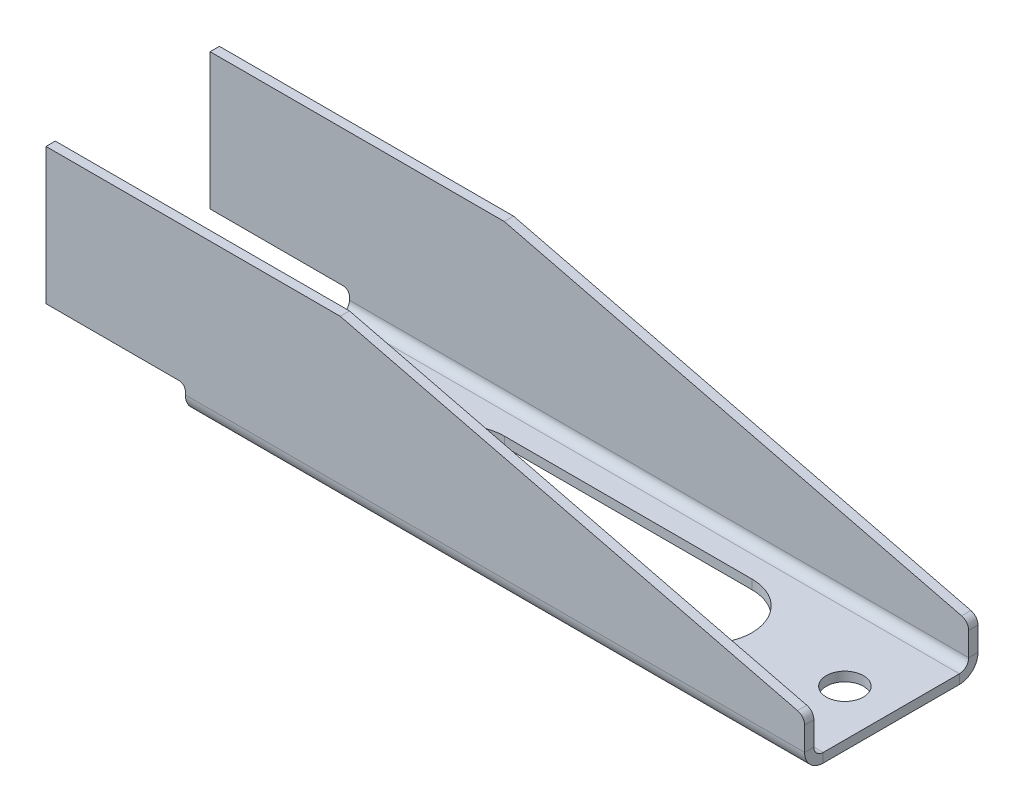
ISO-10303-21;
HEADER;
FILE_DESCRIPTION(('STEP AP214'),'2;1');
FILE_NAME('part.step','',(''),(''),'','','');
FILE_SCHEMA(('AUTOMOTIVE_DESIGN { 1 0 10303 214 1 1 1 1 }'));
ENDSEC;
DATA;
#1=APPLICATION_CONTEXT('core data for automotive mechanical design processes');
#2=APPLICATION_PROTOCOL_DEFINITION('international standard','automotive_design',2000,#1);
#3=PRODUCT_CONTEXT('',#1,'mechanical');
#4=PRODUCT('Part','Part','',(#3));
#5=PRODUCT_RELATED_PRODUCT_CATEGORY('part','',(#4));
#6=PRODUCT_DEFINITION_FORMATION('','',#4);
#7=PRODUCT_DEFINITION_CONTEXT('part definition',#1,'design');
#8=PRODUCT_DEFINITION('design','',#6,#7);
#9=PRODUCT_DEFINITION_SHAPE('','',#8);
#10=(LENGTH_UNIT() NAMED_UNIT(*) SI_UNIT(.MILLI.,.METRE.));
#11=(NAMED_UNIT(*) PLANE_ANGLE_UNIT() SI_UNIT($,.RADIAN.));
#12=(NAMED_UNIT(*) SI_UNIT($,.STERADIAN.) SOLID_ANGLE_UNIT());
#13=UNCERTAINTY_MEASURE_WITH_UNIT(LENGTH_MEASURE(1.E-05),#10,'distance_accuracy_value','');
#14=(GEOMETRIC_REPRESENTATION_CONTEXT(3) GLOBAL_UNCERTAINTY_ASSIGNED_CONTEXT((#13)) GLOBAL_UNIT_ASSIGNED_CONTEXT((#10,
#11,#12)) REPRESENTATION_CONTEXT('',''));
#15=CARTESIAN_POINT('',(0.,0.,0.));
#16=DIRECTION('',(0.,0.,1.));
#17=DIRECTION('',(1.,0.,0.));
#18=AXIS2_PLACEMENT_3D('',#15,#16,#17);
#19=CARTESIAN_POINT('',(0.,53.,-50.0000000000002));
#20=DIRECTION('',(1.,0.,0.));
#21=DIRECTION('',(0.,0.,-1.));
#22=AXIS2_PLACEMENT_3D('',#19,#20,#21);
#23=PLANE('',#22);
#24=DIRECTION('',(0.,-1.,0.));
#25=VECTOR('',#24,1.);
#26=CARTESIAN_POINT('',(0.,53.,-47.0000000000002));
#27=LINE('',#26,#25);
#28=CARTESIAN_POINT('',(0.,5.99999999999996,-47.));
#29=VERTEX_POINT('',#28);
#30=CARTESIAN_POINT('',(0.,6.99999999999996,-47.));
#31=VERTEX_POINT('',#30);
#32=EDGE_CURVE('E375',#29,#31,#27,.F.);
#33=ORIENTED_EDGE('',*,*,#32,.T.);
#34=DIRECTION('',(0.,0.,1.));
#35=VECTOR('',#34,1.);
#36=CARTESIAN_POINT('',(0.,6.99999999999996,-50.));
#37=LINE('',#36,#35);
#38=CARTESIAN_POINT('',(0.,6.99999999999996,-50.));
#39=VERTEX_POINT('',#38);
#40=EDGE_CURVE('E479',#31,#39,#37,.F.);
#41=ORIENTED_EDGE('',*,*,#40,.T.);
#42=DIRECTION('',(0.,1.,0.));
#43=VECTOR('',#42,1.);
#44=CARTESIAN_POINT('',(0.,53.,-50.0000000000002));
#45=LINE('',#44,#43);
#46=CARTESIAN_POINT('',(0.,6.00000000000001,-50.));
#47=VERTEX_POINT('',#46);
#48=EDGE_CURVE('E268',#47,#39,#45,.T.);
#49=ORIENTED_EDGE('',*,*,#48,.F.);
#50=DIRECTION('',(0.,0.,1.));
#51=VECTOR('',#50,1.);
#52=CARTESIAN_POINT('',(0.,5.99999999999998,-47.));
#53=LINE('',#52,#51);
#54=EDGE_CURVE('E383',#29,#47,#53,.F.);
#55=ORIENTED_EDGE('',*,*,#54,.F.);
#56=EDGE_LOOP('',(#33,#41,#49,#55));
#57=FACE_BOUND('',#56,.T.);
#58=ADVANCED_FACE('F74',(#57),#23,.F.);
#59=CARTESIAN_POINT('',(0.,3.,5.99999999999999));
#60=DIRECTION('',(1.,0.,0.));
#61=DIRECTION('',(0.,0.,-1.));
#62=AXIS2_PLACEMENT_3D('',#59,#60,#61);
#63=PLANE('',#62);
#64=DIRECTION('',(0.,-1.,0.));
#65=VECTOR('',#64,1.);
#66=CARTESIAN_POINT('',(0.,3.,5.99999999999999));
#67=LINE('',#66,#65);
#68=CARTESIAN_POINT('',(0.,6.99999999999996,5.99999999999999));
#69=VERTEX_POINT('',#68);
#70=CARTESIAN_POINT('',(0.,5.99999999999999,5.99999999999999));
#71=VERTEX_POINT('',#70);
#72=EDGE_CURVE('E402',#69,#71,#67,.T.);
#73=ORIENTED_EDGE('',*,*,#72,.F.);
#74=DIRECTION('',(0.,0.,1.));
#75=VECTOR('',#74,1.);
#76=CARTESIAN_POINT('',(0.,6.99999999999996,2.99999999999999));
#77=LINE('',#76,#75);
#78=CARTESIAN_POINT('',(0.,6.99999999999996,2.99999999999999));
#79=VERTEX_POINT('',#78);
#80=EDGE_CURVE('E474',#69,#79,#77,.F.);
#81=ORIENTED_EDGE('',*,*,#80,.T.);
#82=DIRECTION('',(0.,1.,0.));
#83=VECTOR('',#82,1.);
#84=CARTESIAN_POINT('',(0.,3.,2.99999999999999));
#85=LINE('',#84,#83);
#86=CARTESIAN_POINT('',(0.,5.99999999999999,2.99999999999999));
#87=VERTEX_POINT('',#86);
#88=EDGE_CURVE('E409',#79,#87,#85,.F.);
#89=ORIENTED_EDGE('',*,*,#88,.T.);
#90=DIRECTION('',(0.,0.,-1.));
#91=VECTOR('',#90,1.);
#92=CARTESIAN_POINT('',(0.,5.99999999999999,5.99999999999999));
#93=LINE('',#92,#91);
#94=EDGE_CURVE('E393',#87,#71,#93,.F.);
#95=ORIENTED_EDGE('',*,*,#94,.T.);
#96=EDGE_LOOP('',(#73,#81,#89,#95));
#97=FACE_BOUND('',#96,.T.);
#98=ADVANCED_FACE('F521',(#97),#63,.F.);
#99=CARTESIAN_POINT('',(0.,3.,0.));
#100=DIRECTION('',(1.,0.,0.));
#101=DIRECTION('',(0.,0.,-1.));
#102=AXIS2_PLACEMENT_3D('',#99,#100,#101);
#103=PLANE('',#102);
#104=DIRECTION('',(0.,0.,1.));
#105=VECTOR('',#104,1.);
#106=CARTESIAN_POINT('',(0.,0.,0.));
#107=LINE('',#106,#105);
#108=CARTESIAN_POINT('',(0.,0.,-44.));
#109=VERTEX_POINT('',#108);
#110=CARTESIAN_POINT('',(0.,0.,-37.));
#111=VERTEX_POINT('',#110);
#112=EDGE_CURVE('E449',#109,#111,#107,.T.);
#113=ORIENTED_EDGE('',*,*,#112,.T.);
#114=DIRECTION('',(0.,1.,0.));
#115=VECTOR('',#114,1.);
#116=CARTESIAN_POINT('',(0.,-0.00100000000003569,-37.));
#117=LINE('',#116,#115);
#118=CARTESIAN_POINT('',(0.,3.,-37.));
#119=VERTEX_POINT('',#118);
#120=EDGE_CURVE('E350',#111,#119,#117,.T.);
#121=ORIENTED_EDGE('',*,*,#120,.T.);
#122=DIRECTION('',(0.,0.,1.));
#123=VECTOR('',#122,1.);
#124=CARTESIAN_POINT('',(0.,3.,0.));
#125=LINE('',#124,#123);
#126=CARTESIAN_POINT('',(0.,3.,-44.));
#127=VERTEX_POINT('',#126);
#128=EDGE_CURVE('E438',#127,#119,#125,.T.);
#129=ORIENTED_EDGE('',*,*,#128,.F.);
#130=DIRECTION('',(0.,-1.,0.));
#131=VECTOR('',#130,1.);
#132=CARTESIAN_POINT('',(0.,3.,-44.));
#133=LINE('',#132,#131);
#134=EDGE_CURVE('E448',#127,#109,#133,.T.);
#135=ORIENTED_EDGE('',*,*,#134,.T.);
#136=EDGE_LOOP('',(#113,#121,#129,#135));
#137=FACE_BOUND('',#136,.T.);
#138=ADVANCED_FACE('F560',(#137),#103,.F.);
#139=CARTESIAN_POINT('',(200.,53.,5.99999999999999));
#140=DIRECTION('',(-1.,0.,0.));
#141=DIRECTION('',(0.,0.,1.));
#142=AXIS2_PLACEMENT_3D('',#139,#140,#141);
#143=PLANE('',#142);
#144=DIRECTION('',(0.,-1.,0.));
#145=VECTOR('',#144,1.);
#146=CARTESIAN_POINT('',(200.,53.,2.99999999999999));
#147=LINE('',#146,#145);
#148=CARTESIAN_POINT('',(200.,5.99999999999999,2.99999999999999));
#149=VERTEX_POINT('',#148);
#150=CARTESIAN_POINT('',(200.,13.6500809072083,2.99999999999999));
#151=VERTEX_POINT('',#150);
#152=EDGE_CURVE('E413',#149,#151,#147,.F.);
#153=ORIENTED_EDGE('',*,*,#152,.T.);
#154=DIRECTION('',(0.,0.,-1.));
#155=VECTOR('',#154,1.);
#156=CARTESIAN_POINT('',(200.,13.6500809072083,5.99999999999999));
#157=LINE('',#156,#155);
#158=CARTESIAN_POINT('',(200.,13.6500809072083,5.99999999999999));
#159=VERTEX_POINT('',#158);
#160=EDGE_CURVE('E498',#151,#159,#157,.F.);
#161=ORIENTED_EDGE('',*,*,#160,.T.);
#162=DIRECTION('',(0.,1.,0.));
#163=VECTOR('',#162,1.);
#164=CARTESIAN_POINT('',(200.,3.,5.99999999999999));
#165=LINE('',#164,#163);
#166=CARTESIAN_POINT('',(200.,5.99999999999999,5.99999999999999));
#167=VERTEX_POINT('',#166);
#168=EDGE_CURVE('E407',#167,#159,#165,.T.);
#169=ORIENTED_EDGE('',*,*,#168,.F.);
#170=DIRECTION('',(0.,0.,-1.));
#171=VECTOR('',#170,1.);
#172=CARTESIAN_POINT('',(200.,5.99999999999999,3.));
#173=LINE('',#172,#171);
#174=EDGE_CURVE('E419',#149,#167,#173,.F.);
#175=ORIENTED_EDGE('',*,*,#174,.F.);
#176=EDGE_LOOP('',(#153,#161,#169,#175));
#177=FACE_BOUND('',#176,.T.);
#178=ADVANCED_FACE('F504',(#177),#143,.F.);
#179=CARTESIAN_POINT('',(200.,3.,5.99999999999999));
#180=DIRECTION('',(0.,0.,-1.));
#181=DIRECTION('',(-1.,0.,0.));
#182=AXIS2_PLACEMENT_3D('',#179,#180,#181);
#183=PLANE('',#182);
#184=ORIENTED_EDGE('',*,*,#168,.T.);
#185=CARTESIAN_POINT('',(197.,13.6500809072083,5.99999999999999));
#186=DIRECTION('',(0.,0.,-1.));
#187=DIRECTION('',(-1.,0.,0.));
#188=AXIS2_PLACEMENT_3D('',#185,#186,#187);
#189=CIRCLE('',#188,3.);
#190=CARTESIAN_POINT('',(197.718465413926,16.5627785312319,5.99999999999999));
#191=VERTEX_POINT('',#190);
#192=EDGE_CURVE('E96',#159,#191,#189,.F.);
#193=ORIENTED_EDGE('',*,*,#192,.T.);
#194=DIRECTION('',(-0.970899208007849,0.239488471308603,0.));
#195=VECTOR('',#194,1.);
#196=CARTESIAN_POINT('',(203.022749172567,15.2543885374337,5.99999999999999));
#197=LINE('',#196,#195);
#198=CARTESIAN_POINT('',(50.0000000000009,53.,5.99999999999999));
#199=VERTEX_POINT('',#198);
#200=EDGE_CURVE('E356',#191,#199,#197,.T.);
#201=ORIENTED_EDGE('',*,*,#200,.T.);
#202=DIRECTION('',(-1.,0.,0.));
#203=VECTOR('',#202,1.);
#204=CARTESIAN_POINT('',(200.,53.,5.99999999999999));
#205=LINE('',#204,#203);
#206=CARTESIAN_POINT('',(-45.,53.,5.99999999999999));
#207=VERTEX_POINT('',#206);
#208=EDGE_CURVE('E405',#199,#207,#205,.T.);
#209=ORIENTED_EDGE('',*,*,#208,.T.);
#210=DIRECTION('',(0.,1.,0.));
#211=VECTOR('',#210,1.);
#212=CARTESIAN_POINT('',(-45.,8.99999999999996,5.99999999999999));
#213=LINE('',#212,#211);
#214=CARTESIAN_POINT('',(-45.,8.99999999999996,5.99999999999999));
#215=VERTEX_POINT('',#214);
#216=EDGE_CURVE('E291',#215,#207,#213,.T.);
#217=ORIENTED_EDGE('',*,*,#216,.F.);
#218=DIRECTION('',(1.,0.,0.));
#219=VECTOR('',#218,1.);
#220=CARTESIAN_POINT('',(-45.,8.99999999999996,5.99999999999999));
#221=LINE('',#220,#219);
#222=CARTESIAN_POINT('',(-2.00000000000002,8.99999999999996,5.99999999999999));
#223=VERTEX_POINT('',#222);
#224=EDGE_CURVE('E301',#215,#223,#221,.T.);
#225=ORIENTED_EDGE('',*,*,#224,.T.);
#226=CARTESIAN_POINT('',(-2.,6.99999999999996,5.99999999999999));
#227=DIRECTION('',(0.,0.,-1.));
#228=DIRECTION('',(-1.,0.,0.));
#229=AXIS2_PLACEMENT_3D('',#226,#227,#228);
#230=CIRCLE('',#229,2.);
#231=EDGE_CURVE('E481',#223,#69,#230,.T.);
#232=ORIENTED_EDGE('',*,*,#231,.T.);
#233=ORIENTED_EDGE('',*,*,#72,.T.);
#234=DIRECTION('',(1.,0.,0.));
#235=VECTOR('',#234,1.);
#236=CARTESIAN_POINT('',(0.,5.99999999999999,5.99999999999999));
#237=LINE('',#236,#235);
#238=EDGE_CURVE('E416',#167,#71,#237,.F.);
#239=ORIENTED_EDGE('',*,*,#238,.F.);
#240=EDGE_LOOP('',(#184,#193,#201,#209,#217,#225,#232,#233,#239));
#241=FACE_BOUND('',#240,.T.);
#242=ADVANCED_FACE('F510',(#241),#183,.F.);
#243=CARTESIAN_POINT('',(200.,3.,2.99999999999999));
#244=DIRECTION('',(0.,0.,-1.));
#245=DIRECTION('',(-1.,0.,0.));
#246=AXIS2_PLACEMENT_3D('',#243,#244,#245);
#247=PLANE('',#246);
#248=DIRECTION('',(-0.970899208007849,0.239488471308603,0.));
#249=VECTOR('',#248,1.);
#250=CARTESIAN_POINT('',(203.022749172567,15.2543885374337,2.99999999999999));
#251=LINE('',#250,#249);
#252=CARTESIAN_POINT('',(197.718465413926,16.5627785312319,2.99999999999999));
#253=VERTEX_POINT('',#252);
#254=CARTESIAN_POINT('',(50.0000000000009,53.,2.99999999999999));
#255=VERTEX_POINT('',#254);
#256=EDGE_CURVE('E353',#253,#255,#251,.T.);
#257=ORIENTED_EDGE('',*,*,#256,.F.);
#258=CARTESIAN_POINT('',(197.,13.6500809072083,2.99999999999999));
#259=DIRECTION('',(0.,0.,-1.));
#260=DIRECTION('',(-1.,0.,0.));
#261=AXIS2_PLACEMENT_3D('',#258,#259,#260);
#262=CIRCLE('',#261,3.);
#263=EDGE_CURVE('E13',#253,#151,#262,.T.);
#264=ORIENTED_EDGE('',*,*,#263,.T.);
#265=ORIENTED_EDGE('',*,*,#152,.F.);
#266=DIRECTION('',(1.,0.,0.));
#267=VECTOR('',#266,1.);
#268=CARTESIAN_POINT('',(0.,5.99999999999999,2.99999999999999));
#269=LINE('',#268,#267);
#270=EDGE_CURVE('E422',#87,#149,#269,.T.);
#271=ORIENTED_EDGE('',*,*,#270,.F.);
#272=ORIENTED_EDGE('',*,*,#88,.F.);
#273=CARTESIAN_POINT('',(-2.,6.99999999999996,2.99999999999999));
#274=DIRECTION('',(0.,0.,-1.));
#275=DIRECTION('',(-1.,0.,0.));
#276=AXIS2_PLACEMENT_3D('',#273,#274,#275);
#277=CIRCLE('',#276,2.);
#278=CARTESIAN_POINT('',(-2.00000000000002,8.99999999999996,2.99999999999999));
#279=VERTEX_POINT('',#278);
#280=EDGE_CURVE('E483',#79,#279,#277,.F.);
#281=ORIENTED_EDGE('',*,*,#280,.T.);
#282=DIRECTION('',(1.,0.,0.));
#283=VECTOR('',#282,1.);
#284=CARTESIAN_POINT('',(-45.,8.99999999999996,2.99999999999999));
#285=LINE('',#284,#283);
#286=CARTESIAN_POINT('',(-45.,8.99999999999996,2.99999999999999));
#287=VERTEX_POINT('',#286);
#288=EDGE_CURVE('E304',#287,#279,#285,.T.);
#289=ORIENTED_EDGE('',*,*,#288,.F.);
#290=DIRECTION('',(0.,-1.,0.));
#291=VECTOR('',#290,1.);
#292=CARTESIAN_POINT('',(-45.,53.,2.99999999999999));
#293=LINE('',#292,#291);
#294=CARTESIAN_POINT('',(-45.,53.,2.99999999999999));
#295=VERTEX_POINT('',#294);
#296=EDGE_CURVE('E297',#295,#287,#293,.T.);
#297=ORIENTED_EDGE('',*,*,#296,.F.);
#298=DIRECTION('',(1.,0.,0.));
#299=VECTOR('',#298,1.);
#300=CARTESIAN_POINT('',(0.,53.,2.99999999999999));
#301=LINE('',#300,#299);
#302=EDGE_CURVE('E411',#255,#295,#301,.F.);
#303=ORIENTED_EDGE('',*,*,#302,.F.);
#304=EDGE_LOOP('',(#257,#264,#265,#271,#272,#281,#289,#297,#303));
#305=FACE_BOUND('',#304,.T.);
#306=ADVANCED_FACE('F527',(#305),#247,.T.);
#307=CARTESIAN_POINT('',(0.,53.,5.99999999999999));
#308=DIRECTION('',(0.,-1.,0.));
#309=DIRECTION('',(0.,0.,-1.));
#310=AXIS2_PLACEMENT_3D('',#307,#308,#309);
#311=PLANE('',#310);
#312=DIRECTION('',(0.,0.,-1.));
#313=VECTOR('',#312,1.);
#314=CARTESIAN_POINT('',(50.0000000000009,53.,2.99999999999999));
#315=LINE('',#314,#313);
#316=EDGE_CURVE('E358',#255,#199,#315,.F.);
#317=ORIENTED_EDGE('',*,*,#316,.F.);
#318=ORIENTED_EDGE('',*,*,#302,.T.);
#319=DIRECTION('',(0.,0.,-1.));
#320=VECTOR('',#319,1.);
#321=CARTESIAN_POINT('',(-45.,53.,5.99999999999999));
#322=LINE('',#321,#320);
#323=EDGE_CURVE('E294',#207,#295,#322,.T.);
#324=ORIENTED_EDGE('',*,*,#323,.F.);
#325=ORIENTED_EDGE('',*,*,#208,.F.);
#326=EDGE_LOOP('',(#317,#318,#324,#325));
#327=FACE_BOUND('',#326,.T.);
#328=ADVANCED_FACE('F545',(#327),#311,.F.);
#329=CARTESIAN_POINT('',(200.,2.99999999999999,-50.));
#330=DIRECTION('',(-1.,0.,0.));
#331=DIRECTION('',(0.,0.,1.));
#332=AXIS2_PLACEMENT_3D('',#329,#330,#331);
#333=PLANE('',#332);
#334=DIRECTION('',(0.,-1.,0.));
#335=VECTOR('',#334,1.);
#336=CARTESIAN_POINT('',(200.,53.,-50.0000000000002));
#337=LINE('',#336,#335);
#338=CARTESIAN_POINT('',(200.,13.6500809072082,-50.));
#339=VERTEX_POINT('',#338);
#340=CARTESIAN_POINT('',(200.,5.99999999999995,-50.));
#341=VERTEX_POINT('',#340);
#342=EDGE_CURVE('E371',#339,#341,#337,.T.);
#343=ORIENTED_EDGE('',*,*,#342,.F.);
#344=DIRECTION('',(0.,0.,1.));
#345=VECTOR('',#344,1.);
#346=CARTESIAN_POINT('',(200.,13.6500809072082,-47.0000000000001));
#347=LINE('',#346,#345);
#348=CARTESIAN_POINT('',(200.,13.6500809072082,-47.));
#349=VERTEX_POINT('',#348);
#350=EDGE_CURVE('E494',#339,#349,#347,.T.);
#351=ORIENTED_EDGE('',*,*,#350,.T.);
#352=DIRECTION('',(0.,1.,0.));
#353=VECTOR('',#352,1.);
#354=CARTESIAN_POINT('',(200.,3.,-47.));
#355=LINE('',#354,#353);
#356=CARTESIAN_POINT('',(200.,5.99999999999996,-47.));
#357=VERTEX_POINT('',#356);
#358=EDGE_CURVE('E378',#349,#357,#355,.F.);
#359=ORIENTED_EDGE('',*,*,#358,.T.);
#360=DIRECTION('',(0.,0.,1.));
#361=VECTOR('',#360,1.);
#362=CARTESIAN_POINT('',(200.,6.00000000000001,-50.));
#363=LINE('',#362,#361);
#364=EDGE_CURVE('E367',#357,#341,#363,.F.);
#365=ORIENTED_EDGE('',*,*,#364,.T.);
#366=EDGE_LOOP('',(#343,#351,#359,#365));
#367=FACE_BOUND('',#366,.T.);
#368=ADVANCED_FACE('F565',(#367),#333,.F.);
#369=CARTESIAN_POINT('',(200.,53.,-50.0000000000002));
#370=DIRECTION('',(0.,0.,1.));
#371=DIRECTION('',(0.,-1.,0.));
#372=AXIS2_PLACEMENT_3D('',#369,#370,#371);
#373=PLANE('',#372);
#374=DIRECTION('',(0.970899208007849,-0.239488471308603,0.));
#375=VECTOR('',#374,1.);
#376=CARTESIAN_POINT('',(191.39679081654,18.1221249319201,-50.));
#377=LINE('',#376,#375);
#378=CARTESIAN_POINT('',(50.0000000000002,53.,-50.0000000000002));
#379=VERTEX_POINT('',#378);
#380=CARTESIAN_POINT('',(197.718465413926,16.5627785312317,-50.));
#381=VERTEX_POINT('',#380);
#382=EDGE_CURVE('E363',#379,#381,#377,.T.);
#383=ORIENTED_EDGE('',*,*,#382,.T.);
#384=CARTESIAN_POINT('',(197.,13.6500809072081,-50.));
#385=DIRECTION('',(0.,0.,1.));
#386=DIRECTION('',(0.,-1.,0.));
#387=AXIS2_PLACEMENT_3D('',#384,#385,#386);
#388=CIRCLE('',#387,3.);
#389=EDGE_CURVE('E492',#381,#339,#388,.F.);
#390=ORIENTED_EDGE('',*,*,#389,.T.);
#391=ORIENTED_EDGE('',*,*,#342,.T.);
#392=DIRECTION('',(-1.,0.,0.));
#393=VECTOR('',#392,1.);
#394=CARTESIAN_POINT('',(200.,6.00000000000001,-50.));
#395=LINE('',#394,#393);
#396=EDGE_CURVE('E380',#47,#341,#395,.F.);
#397=ORIENTED_EDGE('',*,*,#396,.F.);
#398=ORIENTED_EDGE('',*,*,#48,.T.);
#399=CARTESIAN_POINT('',(-2.,6.99999999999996,-50.));
#400=DIRECTION('',(0.,0.,1.));
#401=DIRECTION('',(0.,-1.,0.));
#402=AXIS2_PLACEMENT_3D('',#399,#400,#401);
#403=CIRCLE('',#402,2.);
#404=CARTESIAN_POINT('',(-2.00000000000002,8.99999999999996,-50.0000000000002));
#405=VERTEX_POINT('',#404);
#406=EDGE_CURVE('E487',#39,#405,#403,.T.);
#407=ORIENTED_EDGE('',*,*,#406,.T.);
#408=DIRECTION('',(1.,0.,0.));
#409=VECTOR('',#408,1.);
#410=CARTESIAN_POINT('',(-45.,8.99999999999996,-50.0000000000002));
#411=LINE('',#410,#409);
#412=CARTESIAN_POINT('',(-45.,8.99999999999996,-50.0000000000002));
#413=VERTEX_POINT('',#412);
#414=EDGE_CURVE('E274',#413,#405,#411,.T.);
#415=ORIENTED_EDGE('',*,*,#414,.F.);
#416=DIRECTION('',(0.,-1.,0.));
#417=VECTOR('',#416,1.);
#418=CARTESIAN_POINT('',(-45.,8.99999999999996,-50.0000000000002));
#419=LINE('',#418,#417);
#420=CARTESIAN_POINT('',(-45.,53.,-50.0000000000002));
#421=VERTEX_POINT('',#420);
#422=EDGE_CURVE('E271',#421,#413,#419,.T.);
#423=ORIENTED_EDGE('',*,*,#422,.F.);
#424=DIRECTION('',(1.,0.,0.));
#425=VECTOR('',#424,1.);
#426=CARTESIAN_POINT('',(200.,53.,-50.0000000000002));
#427=LINE('',#426,#425);
#428=EDGE_CURVE('E258',#421,#379,#427,.T.);
#429=ORIENTED_EDGE('',*,*,#428,.T.);
#430=EDGE_LOOP('',(#383,#390,#391,#397,#398,#407,#415,#423,#429));
#431=FACE_BOUND('',#430,.T.);
#432=ADVANCED_FACE('F272',(#431),#373,.F.);
#433=CARTESIAN_POINT('',(200.,53.,-47.0000000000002));
#434=DIRECTION('',(0.,0.,1.));
#435=DIRECTION('',(0.,-1.,0.));
#436=AXIS2_PLACEMENT_3D('',#433,#434,#435);
#437=PLANE('',#436);
#438=ORIENTED_EDGE('',*,*,#358,.F.);
#439=CARTESIAN_POINT('',(197.,13.6500809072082,-47.));
#440=DIRECTION('',(0.,0.,1.));
#441=DIRECTION('',(0.,-1.,0.));
#442=AXIS2_PLACEMENT_3D('',#439,#440,#441);
#443=CIRCLE('',#442,3.);
#444=CARTESIAN_POINT('',(197.718465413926,16.5627785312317,-47.));
#445=VERTEX_POINT('',#444);
#446=EDGE_CURVE('E496',#349,#445,#443,.T.);
#447=ORIENTED_EDGE('',*,*,#446,.T.);
#448=DIRECTION('',(0.970899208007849,-0.239488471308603,0.));
#449=VECTOR('',#448,1.);
#450=CARTESIAN_POINT('',(191.39679081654,18.1221249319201,-47.));
#451=LINE('',#450,#449);
#452=CARTESIAN_POINT('',(50.0000000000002,53.,-47.0000000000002));
#453=VERTEX_POINT('',#452);
#454=EDGE_CURVE('E362',#453,#445,#451,.T.);
#455=ORIENTED_EDGE('',*,*,#454,.F.);
#456=DIRECTION('',(-1.,0.,0.));
#457=VECTOR('',#456,1.);
#458=CARTESIAN_POINT('',(200.,53.,-47.0000000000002));
#459=LINE('',#458,#457);
#460=CARTESIAN_POINT('',(-45.,53.,-47.0000000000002));
#461=VERTEX_POINT('',#460);
#462=EDGE_CURVE('E373',#461,#453,#459,.F.);
#463=ORIENTED_EDGE('',*,*,#462,.F.);
#464=DIRECTION('',(0.,1.,0.));
#465=VECTOR('',#464,1.);
#466=CARTESIAN_POINT('',(-45.,53.,-47.0000000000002));
#467=LINE('',#466,#465);
#468=CARTESIAN_POINT('',(-45.,8.99999999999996,-47.0000000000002));
#469=VERTEX_POINT('',#468);
#470=EDGE_CURVE('E282',#469,#461,#467,.T.);
#471=ORIENTED_EDGE('',*,*,#470,.F.);
#472=DIRECTION('',(1.,0.,0.));
#473=VECTOR('',#472,1.);
#474=CARTESIAN_POINT('',(-45.,8.99999999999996,-47.0000000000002));
#475=LINE('',#474,#473);
#476=CARTESIAN_POINT('',(-2.00000000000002,8.99999999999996,-47.0000000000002));
#477=VERTEX_POINT('',#476);
#478=EDGE_CURVE('E287',#469,#477,#475,.T.);
#479=ORIENTED_EDGE('',*,*,#478,.T.);
#480=CARTESIAN_POINT('',(-2.,6.99999999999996,-47.));
#481=DIRECTION('',(0.,0.,1.));
#482=DIRECTION('',(0.,-1.,0.));
#483=AXIS2_PLACEMENT_3D('',#480,#481,#482);
#484=CIRCLE('',#483,2.);
#485=EDGE_CURVE('E485',#477,#31,#484,.F.);
#486=ORIENTED_EDGE('',*,*,#485,.T.);
#487=ORIENTED_EDGE('',*,*,#32,.F.);
#488=DIRECTION('',(-1.,0.,0.));
#489=VECTOR('',#488,1.);
#490=CARTESIAN_POINT('',(200.,5.99999999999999,-47.));
#491=LINE('',#490,#489);
#492=EDGE_CURVE('E386',#357,#29,#491,.T.);
#493=ORIENTED_EDGE('',*,*,#492,.F.);
#494=EDGE_LOOP('',(#438,#447,#455,#463,#471,#479,#486,#487,#493));
#495=FACE_BOUND('',#494,.T.);
#496=ADVANCED_FACE('F638',(#495),#437,.T.);
#497=CARTESIAN_POINT('',(200.,53.,-50.0000000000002));
#498=DIRECTION('',(0.,-1.,0.));
#499=DIRECTION('',(0.,0.,-1.));
#500=AXIS2_PLACEMENT_3D('',#497,#498,#499);
#501=PLANE('',#500);
#502=DIRECTION('',(0.,0.,1.));
#503=VECTOR('',#502,1.);
#504=CARTESIAN_POINT('',(50.0000000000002,53.,-47.0000000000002));
#505=LINE('',#504,#503);
#506=EDGE_CURVE('E264',#453,#379,#505,.F.);
#507=ORIENTED_EDGE('',*,*,#506,.T.);
#508=ORIENTED_EDGE('',*,*,#428,.F.);
#509=DIRECTION('',(0.,0.,-1.));
#510=VECTOR('',#509,1.);
#511=CARTESIAN_POINT('',(-45.,53.,-50.0000000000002));
#512=LINE('',#511,#510);
#513=EDGE_CURVE('E263',#461,#421,#512,.T.);
#514=ORIENTED_EDGE('',*,*,#513,.F.);
#515=ORIENTED_EDGE('',*,*,#462,.T.);
#516=EDGE_LOOP('',(#507,#508,#514,#515));
#517=FACE_BOUND('',#516,.T.);
#518=ADVANCED_FACE('F260',(#517),#501,.F.);
#519=CARTESIAN_POINT('',(0.,3.,-7.00000000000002));
#520=VERTEX_POINT('',#519);
#521=CARTESIAN_POINT('',(0.,3.,0.));
#522=VERTEX_POINT('',#521);
#523=EDGE_CURVE('E442',#520,#522,#125,.T.);
#524=ORIENTED_EDGE('',*,*,#523,.F.);
#525=DIRECTION('',(0.,1.,0.));
#526=VECTOR('',#525,1.);
#527=CARTESIAN_POINT('',(0.,-0.00100000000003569,-7.00000000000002));
#528=LINE('',#527,#526);
#529=CARTESIAN_POINT('',(0.,0.,-7.00000000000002));
#530=VERTEX_POINT('',#529);
#531=EDGE_CURVE('E351',#530,#520,#528,.T.);
#532=ORIENTED_EDGE('',*,*,#531,.F.);
#533=CARTESIAN_POINT('',(0.,0.,0.));
#534=VERTEX_POINT('',#533);
#535=EDGE_CURVE('E429',#530,#534,#107,.T.);
#536=ORIENTED_EDGE('',*,*,#535,.T.);
#537=DIRECTION('',(0.,-1.,0.));
#538=VECTOR('',#537,1.);
#539=CARTESIAN_POINT('',(0.,3.,0.));
#540=LINE('',#539,#538);
#541=EDGE_CURVE('E468',#522,#534,#540,.T.);
#542=ORIENTED_EDGE('',*,*,#541,.F.);
#543=EDGE_LOOP('',(#524,#532,#536,#542));
#544=FACE_BOUND('',#543,.T.);
#545=ADVANCED_FACE('F617',(#544),#103,.F.);
#546=CARTESIAN_POINT('',(200.,3.,0.));
#547=DIRECTION('',(-1.,0.,0.));
#548=DIRECTION('',(0.,0.,1.));
#549=AXIS2_PLACEMENT_3D('',#546,#547,#548);
#550=PLANE('',#549);
#551=DIRECTION('',(0.,0.,-1.));
#552=VECTOR('',#551,1.);
#553=CARTESIAN_POINT('',(200.,0.,0.));
#554=LINE('',#553,#552);
#555=CARTESIAN_POINT('',(200.,0.,0.));
#556=VERTEX_POINT('',#555);
#557=CARTESIAN_POINT('',(200.,0.,-44.));
#558=VERTEX_POINT('',#557);
#559=EDGE_CURVE('E455',#556,#558,#554,.T.);
#560=ORIENTED_EDGE('',*,*,#559,.T.);
#561=DIRECTION('',(0.,-1.,0.));
#562=VECTOR('',#561,1.);
#563=CARTESIAN_POINT('',(200.,3.,-44.));
#564=LINE('',#563,#562);
#565=CARTESIAN_POINT('',(200.,3.,-44.));
#566=VERTEX_POINT('',#565);
#567=EDGE_CURVE('E462',#566,#558,#564,.T.);
#568=ORIENTED_EDGE('',*,*,#567,.F.);
#569=DIRECTION('',(0.,0.,-1.));
#570=VECTOR('',#569,1.);
#571=CARTESIAN_POINT('',(200.,3.,0.));
#572=LINE('',#571,#570);
#573=CARTESIAN_POINT('',(200.,3.,0.));
#574=VERTEX_POINT('',#573);
#575=EDGE_CURVE('E444',#574,#566,#572,.T.);
#576=ORIENTED_EDGE('',*,*,#575,.F.);
#577=DIRECTION('',(0.,-1.,0.));
#578=VECTOR('',#577,1.);
#579=CARTESIAN_POINT('',(200.,3.,0.));
#580=LINE('',#579,#578);
#581=EDGE_CURVE('E465',#574,#556,#580,.T.);
#582=ORIENTED_EDGE('',*,*,#581,.T.);
#583=EDGE_LOOP('',(#560,#568,#576,#582));
#584=FACE_BOUND('',#583,.T.);
#585=ADVANCED_FACE('F610',(#584),#550,.F.);
#586=CARTESIAN_POINT('',(0.,3.,-44.));
#587=DIRECTION('',(0.,-1.,0.));
#588=DIRECTION('',(0.,0.,-1.));
#589=AXIS2_PLACEMENT_3D('',#586,#587,#588);
#590=PLANE('',#589);
#591=CARTESIAN_POINT('',(185.,3.,-22.));
#592=DIRECTION('',(0.,1.,0.));
#593=DIRECTION('',(0.,0.,1.));
#594=AXIS2_PLACEMENT_3D('',#591,#592,#593);
#595=CIRCLE('',#594,6.00000000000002);
#596=CARTESIAN_POINT('',(185.,3.,-16.));
#597=VERTEX_POINT('',#596);
#598=EDGE_CURVE('E308',#597,#597,#595,.T.);
#599=ORIENTED_EDGE('',*,*,#598,.F.);
#600=EDGE_LOOP('',(#599));
#601=FACE_BOUND('',#600,.T.);
#602=DIRECTION('',(-1.,0.,0.));
#603=VECTOR('',#602,1.);
#604=CARTESIAN_POINT('',(140.,3.,-37.));
#605=LINE('',#604,#603);
#606=CARTESIAN_POINT('',(140.,3.,-37.));
#607=VERTEX_POINT('',#606);
#608=CARTESIAN_POINT('',(60.,3.,-37.));
#609=VERTEX_POINT('',#608);
#610=EDGE_CURVE('E324',#607,#609,#605,.T.);
#611=ORIENTED_EDGE('',*,*,#610,.F.);
#612=CARTESIAN_POINT('',(140.,3.,-22.));
#613=DIRECTION('',(0.,1.,0.));
#614=DIRECTION('',(0.,0.,1.));
#615=AXIS2_PLACEMENT_3D('',#612,#613,#614);
#616=CIRCLE('',#615,15.);
#617=CARTESIAN_POINT('',(140.,3.,-6.99999999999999));
#618=VERTEX_POINT('',#617);
#619=EDGE_CURVE('E322',#618,#607,#616,.T.);
#620=ORIENTED_EDGE('',*,*,#619,.F.);
#621=DIRECTION('',(1.,0.,0.));
#622=VECTOR('',#621,1.);
#623=CARTESIAN_POINT('',(140.,3.,-6.99999999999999));
#624=LINE('',#623,#622);
#625=CARTESIAN_POINT('',(60.,3.,-6.99999999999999));
#626=VERTEX_POINT('',#625);
#627=EDGE_CURVE('E330',#626,#618,#624,.T.);
#628=ORIENTED_EDGE('',*,*,#627,.F.);
#629=CARTESIAN_POINT('',(60.,3.,-22.));
#630=DIRECTION('',(0.,1.,0.));
#631=DIRECTION('',(0.,0.,1.));
#632=AXIS2_PLACEMENT_3D('',#629,#630,#631);
#633=CIRCLE('',#632,15.);
#634=EDGE_CURVE('E327',#609,#626,#633,.T.);
#635=ORIENTED_EDGE('',*,*,#634,.F.);
#636=EDGE_LOOP('',(#611,#620,#628,#635));
#637=FACE_BOUND('',#636,.T.);
#638=ORIENTED_EDGE('',*,*,#128,.T.);
#639=CARTESIAN_POINT('',(0.,3.,-22.));
#640=DIRECTION('',(0.,1.,0.));
#641=DIRECTION('',(0.,0.,1.));
#642=AXIS2_PLACEMENT_3D('',#639,#640,#641);
#643=CIRCLE('',#642,15.);
#644=EDGE_CURVE('E348',#520,#119,#643,.T.);
#645=ORIENTED_EDGE('',*,*,#644,.F.);
#646=ORIENTED_EDGE('',*,*,#523,.T.);
#647=DIRECTION('',(1.,0.,0.));
#648=VECTOR('',#647,1.);
#649=CARTESIAN_POINT('',(0.,3.,0.));
#650=LINE('',#649,#648);
#651=EDGE_CURVE('E441',#522,#574,#650,.T.);
#652=ORIENTED_EDGE('',*,*,#651,.T.);
#653=ORIENTED_EDGE('',*,*,#575,.T.);
#654=DIRECTION('',(-1.,0.,0.));
#655=VECTOR('',#654,1.);
#656=CARTESIAN_POINT('',(0.,3.,-44.));
#657=LINE('',#656,#655);
#658=EDGE_CURVE('E446',#566,#127,#657,.T.);
#659=ORIENTED_EDGE('',*,*,#658,.T.);
#660=EDGE_LOOP('',(#638,#645,#646,#652,#653,#659));
#661=FACE_BOUND('',#660,.T.);
#662=ADVANCED_FACE('F607',(#601,#637,#661),#590,.F.);
#663=CARTESIAN_POINT('',(0.,0.,-44.));
#664=DIRECTION('',(0.,-1.,0.));
#665=DIRECTION('',(0.,0.,-1.));
#666=AXIS2_PLACEMENT_3D('',#663,#664,#665);
#667=PLANE('',#666);
#668=CARTESIAN_POINT('',(185.,0.,-22.));
#669=DIRECTION('',(0.,-1.,0.));
#670=DIRECTION('',(0.,0.,-1.));
#671=AXIS2_PLACEMENT_3D('',#668,#669,#670);
#672=CIRCLE('',#671,6.00000000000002);
#673=CARTESIAN_POINT('',(185.,0.,-28.));
#674=VERTEX_POINT('',#673);
#675=EDGE_CURVE('E307',#674,#674,#672,.F.);
#676=ORIENTED_EDGE('',*,*,#675,.T.);
#677=EDGE_LOOP('',(#676));
#678=FACE_BOUND('',#677,.T.);
#679=CARTESIAN_POINT('',(140.,0.,-22.));
#680=DIRECTION('',(0.,-1.,0.));
#681=DIRECTION('',(0.,0.,-1.));
#682=AXIS2_PLACEMENT_3D('',#679,#680,#681);
#683=CIRCLE('',#682,15.);
#684=CARTESIAN_POINT('',(140.,0.,-6.99999999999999));
#685=VERTEX_POINT('',#684);
#686=CARTESIAN_POINT('',(140.,0.,-37.));
#687=VERTEX_POINT('',#686);
#688=EDGE_CURVE('E319',#685,#687,#683,.F.);
#689=ORIENTED_EDGE('',*,*,#688,.T.);
#690=DIRECTION('',(-1.,0.,0.));
#691=VECTOR('',#690,1.);
#692=CARTESIAN_POINT('',(140.,0.,-37.));
#693=LINE('',#692,#691);
#694=CARTESIAN_POINT('',(60.,0.,-37.));
#695=VERTEX_POINT('',#694);
#696=EDGE_CURVE('E336',#687,#695,#693,.T.);
#697=ORIENTED_EDGE('',*,*,#696,.T.);
#698=CARTESIAN_POINT('',(60.,0.,-22.));
#699=DIRECTION('',(0.,-1.,0.));
#700=DIRECTION('',(0.,0.,-1.));
#701=AXIS2_PLACEMENT_3D('',#698,#699,#700);
#702=CIRCLE('',#701,15.);
#703=CARTESIAN_POINT('',(60.,0.,-6.99999999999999));
#704=VERTEX_POINT('',#703);
#705=EDGE_CURVE('E311',#695,#704,#702,.F.);
#706=ORIENTED_EDGE('',*,*,#705,.T.);
#707=DIRECTION('',(1.,0.,0.));
#708=VECTOR('',#707,1.);
#709=CARTESIAN_POINT('',(140.,0.,-6.99999999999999));
#710=LINE('',#709,#708);
#711=EDGE_CURVE('E316',#704,#685,#710,.T.);
#712=ORIENTED_EDGE('',*,*,#711,.T.);
#713=EDGE_LOOP('',(#689,#697,#706,#712));
#714=FACE_BOUND('',#713,.T.);
#715=CARTESIAN_POINT('',(0.,0.,-22.));
#716=DIRECTION('',(0.,-1.,0.));
#717=DIRECTION('',(0.,0.,-1.));
#718=AXIS2_PLACEMENT_3D('',#715,#716,#717);
#719=CIRCLE('',#718,15.);
#720=EDGE_CURVE('E345',#530,#111,#719,.F.);
#721=ORIENTED_EDGE('',*,*,#720,.T.);
#722=ORIENTED_EDGE('',*,*,#112,.F.);
#723=DIRECTION('',(-1.,0.,0.));
#724=VECTOR('',#723,1.);
#725=CARTESIAN_POINT('',(0.,0.,-44.));
#726=LINE('',#725,#724);
#727=EDGE_CURVE('E457',#558,#109,#726,.T.);
#728=ORIENTED_EDGE('',*,*,#727,.F.);
#729=ORIENTED_EDGE('',*,*,#559,.F.);
#730=DIRECTION('',(1.,0.,0.));
#731=VECTOR('',#730,1.);
#732=CARTESIAN_POINT('',(0.,0.,0.));
#733=LINE('',#732,#731);
#734=EDGE_CURVE('E452',#534,#556,#733,.T.);
#735=ORIENTED_EDGE('',*,*,#734,.F.);
#736=ORIENTED_EDGE('',*,*,#535,.F.);
#737=EDGE_LOOP('',(#721,#722,#728,#729,#735,#736));
#738=FACE_BOUND('',#737,.T.);
#739=ADVANCED_FACE('F603',(#678,#714,#738),#667,.T.);
#740=CARTESIAN_POINT('',(0.,5.99999999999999,0.));
#741=DIRECTION('',(-1.,0.,0.));
#742=DIRECTION('',(0.,0.,1.));
#743=AXIS2_PLACEMENT_3D('',#740,#741,#742);
#744=PLANE('',#743);
#745=ORIENTED_EDGE('',*,*,#94,.F.);
#746=CARTESIAN_POINT('',(0.,5.99999999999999,0.));
#747=DIRECTION('',(1.,0.,0.));
#748=DIRECTION('',(0.,0.,-1.));
#749=AXIS2_PLACEMENT_3D('',#746,#747,#748);
#750=CIRCLE('',#749,2.99999999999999);
#751=EDGE_CURVE('E433',#522,#87,#750,.F.);
#752=ORIENTED_EDGE('',*,*,#751,.F.);
#753=ORIENTED_EDGE('',*,*,#541,.T.);
#754=CARTESIAN_POINT('',(0.,5.99999999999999,0.));
#755=DIRECTION('',(1.,0.,0.));
#756=DIRECTION('',(0.,0.,-1.));
#757=AXIS2_PLACEMENT_3D('',#754,#755,#756);
#758=CIRCLE('',#757,5.99999999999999);
#759=EDGE_CURVE('E426',#534,#71,#758,.F.);
#760=ORIENTED_EDGE('',*,*,#759,.T.);
#761=EDGE_LOOP('',(#745,#752,#753,#760));
#762=FACE_BOUND('',#761,.T.);
#763=ADVANCED_FACE('F517',(#762),#744,.T.);
#764=CARTESIAN_POINT('',(200.,5.99999999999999,0.));
#765=DIRECTION('',(-1.,0.,0.));
#766=DIRECTION('',(0.,0.,1.));
#767=AXIS2_PLACEMENT_3D('',#764,#765,#766);
#768=PLANE('',#767);
#769=CARTESIAN_POINT('',(200.,5.99999999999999,0.));
#770=DIRECTION('',(1.,0.,0.));
#771=DIRECTION('',(0.,0.,-1.));
#772=AXIS2_PLACEMENT_3D('',#769,#770,#771);
#773=CIRCLE('',#772,2.99999999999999);
#774=EDGE_CURVE('E404',#149,#574,#773,.T.);
#775=ORIENTED_EDGE('',*,*,#774,.F.);
#776=ORIENTED_EDGE('',*,*,#174,.T.);
#777=CARTESIAN_POINT('',(200.,5.99999999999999,0.));
#778=DIRECTION('',(1.,0.,0.));
#779=DIRECTION('',(0.,0.,-1.));
#780=AXIS2_PLACEMENT_3D('',#777,#778,#779);
#781=CIRCLE('',#780,5.99999999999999);
#782=EDGE_CURVE('E430',#167,#556,#781,.T.);
#783=ORIENTED_EDGE('',*,*,#782,.T.);
#784=ORIENTED_EDGE('',*,*,#581,.F.);
#785=EDGE_LOOP('',(#775,#776,#783,#784));
#786=FACE_BOUND('',#785,.T.);
#787=ADVANCED_FACE('F597',(#786),#768,.F.);
#788=CARTESIAN_POINT('',(200.,5.99999999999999,0.));
#789=DIRECTION('',(1.,0.,0.));
#790=DIRECTION('',(0.,0.,1.));
#791=AXIS2_PLACEMENT_3D('',#788,#789,#790);
#792=CYLINDRICAL_SURFACE('',#791,5.99999999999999);
#793=ORIENTED_EDGE('',*,*,#734,.T.);
#794=ORIENTED_EDGE('',*,*,#782,.F.);
#795=ORIENTED_EDGE('',*,*,#238,.T.);
#796=ORIENTED_EDGE('',*,*,#759,.F.);
#797=EDGE_LOOP('',(#793,#794,#795,#796));
#798=FACE_BOUND('',#797,.T.);
#799=ADVANCED_FACE('F514',(#798),#792,.T.);
#800=CARTESIAN_POINT('',(200.,5.99999999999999,0.));
#801=DIRECTION('',(1.,0.,0.));
#802=DIRECTION('',(0.,0.,1.));
#803=AXIS2_PLACEMENT_3D('',#800,#801,#802);
#804=CYLINDRICAL_SURFACE('',#803,2.99999999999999);
#805=ORIENTED_EDGE('',*,*,#651,.F.);
#806=ORIENTED_EDGE('',*,*,#751,.T.);
#807=ORIENTED_EDGE('',*,*,#270,.T.);
#808=ORIENTED_EDGE('',*,*,#774,.T.);
#809=EDGE_LOOP('',(#805,#806,#807,#808));
#810=FACE_BOUND('',#809,.T.);
#811=ADVANCED_FACE('F582',(#810),#804,.F.);
#812=CARTESIAN_POINT('',(200.,5.99999999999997,-44.));
#813=DIRECTION('',(1.,0.,0.));
#814=DIRECTION('',(0.,0.,-1.));
#815=AXIS2_PLACEMENT_3D('',#812,#813,#814);
#816=PLANE('',#815);
#817=ORIENTED_EDGE('',*,*,#364,.F.);
#818=CARTESIAN_POINT('',(200.,5.99999999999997,-44.));
#819=DIRECTION('',(-1.,0.,0.));
#820=DIRECTION('',(0.,0.,1.));
#821=AXIS2_PLACEMENT_3D('',#818,#819,#820);
#822=CIRCLE('',#821,3.);
#823=EDGE_CURVE('E397',#566,#357,#822,.F.);
#824=ORIENTED_EDGE('',*,*,#823,.F.);
#825=ORIENTED_EDGE('',*,*,#567,.T.);
#826=CARTESIAN_POINT('',(200.,5.99999999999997,-44.));
#827=DIRECTION('',(-1.,0.,0.));
#828=DIRECTION('',(0.,0.,1.));
#829=AXIS2_PLACEMENT_3D('',#826,#827,#828);
#830=CIRCLE('',#829,6.);
#831=EDGE_CURVE('E390',#558,#341,#830,.F.);
#832=ORIENTED_EDGE('',*,*,#831,.T.);
#833=EDGE_LOOP('',(#817,#824,#825,#832));
#834=FACE_BOUND('',#833,.T.);
#835=ADVANCED_FACE('F575',(#834),#816,.T.);
#836=CARTESIAN_POINT('',(0.,5.99999999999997,-44.));
#837=DIRECTION('',(1.,0.,0.));
#838=DIRECTION('',(0.,0.,-1.));
#839=AXIS2_PLACEMENT_3D('',#836,#837,#838);
#840=PLANE('',#839);
#841=CARTESIAN_POINT('',(0.,5.99999999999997,-44.));
#842=DIRECTION('',(-1.,0.,0.));
#843=DIRECTION('',(0.,0.,1.));
#844=AXIS2_PLACEMENT_3D('',#841,#842,#843);
#845=CIRCLE('',#844,3.);
#846=EDGE_CURVE('E267',#29,#127,#845,.T.);
#847=ORIENTED_EDGE('',*,*,#846,.F.);
#848=ORIENTED_EDGE('',*,*,#54,.T.);
#849=CARTESIAN_POINT('',(0.,5.99999999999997,-44.));
#850=DIRECTION('',(-1.,0.,0.));
#851=DIRECTION('',(0.,0.,1.));
#852=AXIS2_PLACEMENT_3D('',#849,#850,#851);
#853=CIRCLE('',#852,6.);
#854=EDGE_CURVE('E394',#47,#109,#853,.T.);
#855=ORIENTED_EDGE('',*,*,#854,.T.);
#856=ORIENTED_EDGE('',*,*,#134,.F.);
#857=EDGE_LOOP('',(#847,#848,#855,#856));
#858=FACE_BOUND('',#857,.T.);
#859=ADVANCED_FACE('F573',(#858),#840,.F.);
#860=CARTESIAN_POINT('',(0.,5.99999999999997,-44.));
#861=DIRECTION('',(-1.,0.,0.));
#862=DIRECTION('',(0.,0.,-1.));
#863=AXIS2_PLACEMENT_3D('',#860,#861,#862);
#864=CYLINDRICAL_SURFACE('',#863,6.);
#865=ORIENTED_EDGE('',*,*,#727,.T.);
#866=ORIENTED_EDGE('',*,*,#854,.F.);
#867=ORIENTED_EDGE('',*,*,#396,.T.);
#868=ORIENTED_EDGE('',*,*,#831,.F.);
#869=EDGE_LOOP('',(#865,#866,#867,#868));
#870=FACE_BOUND('',#869,.T.);
#871=ADVANCED_FACE('F569',(#870),#864,.T.);
#872=CARTESIAN_POINT('',(0.,5.99999999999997,-44.));
#873=DIRECTION('',(-1.,0.,0.));
#874=DIRECTION('',(0.,0.,-1.));
#875=AXIS2_PLACEMENT_3D('',#872,#873,#874);
#876=CYLINDRICAL_SURFACE('',#875,3.);
#877=ORIENTED_EDGE('',*,*,#658,.F.);
#878=ORIENTED_EDGE('',*,*,#823,.T.);
#879=ORIENTED_EDGE('',*,*,#492,.T.);
#880=ORIENTED_EDGE('',*,*,#846,.T.);
#881=EDGE_LOOP('',(#877,#878,#879,#880));
#882=FACE_BOUND('',#881,.T.);
#883=ADVANCED_FACE('F572',(#882),#876,.F.);
#884=CARTESIAN_POINT('',(191.39679081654,18.1221249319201,-47.));
#885=DIRECTION('',(-0.239488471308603,-0.970899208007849,0.));
#886=DIRECTION('',(0.970899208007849,-0.239488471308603,0.));
#887=AXIS2_PLACEMENT_3D('',#884,#885,#886);
#888=PLANE('',#887);
#889=ORIENTED_EDGE('',*,*,#454,.T.);
#890=DIRECTION('',(0.,0.,-1.));
#891=VECTOR('',#890,1.);
#892=CARTESIAN_POINT('',(197.718465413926,16.5627785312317,-50.));
#893=LINE('',#892,#891);
#894=EDGE_CURVE('E489',#445,#381,#893,.T.);
#895=ORIENTED_EDGE('',*,*,#894,.T.);
#896=ORIENTED_EDGE('',*,*,#382,.F.);
#897=ORIENTED_EDGE('',*,*,#506,.F.);
#898=EDGE_LOOP('',(#889,#895,#896,#897));
#899=FACE_BOUND('',#898,.T.);
#900=ADVANCED_FACE('F578',(#899),#888,.F.);
#901=CARTESIAN_POINT('',(203.022749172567,15.2543885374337,2.99999999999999));
#902=DIRECTION('',(-0.239488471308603,-0.970899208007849,0.));
#903=DIRECTION('',(-0.970899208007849,0.239488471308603,0.));
#904=AXIS2_PLACEMENT_3D('',#901,#902,#903);
#905=PLANE('',#904);
#906=ORIENTED_EDGE('',*,*,#200,.F.);
#907=DIRECTION('',(0.,0.,1.));
#908=VECTOR('',#907,1.);
#909=CARTESIAN_POINT('',(197.718465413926,16.5627785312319,3.));
#910=LINE('',#909,#908);
#911=EDGE_CURVE('E82',#191,#253,#910,.F.);
#912=ORIENTED_EDGE('',*,*,#911,.T.);
#913=ORIENTED_EDGE('',*,*,#256,.T.);
#914=ORIENTED_EDGE('',*,*,#316,.T.);
#915=EDGE_LOOP('',(#906,#912,#913,#914));
#916=FACE_BOUND('',#915,.T.);
#917=ADVANCED_FACE('F546',(#916),#905,.F.);
#918=CARTESIAN_POINT('',(0.,-0.00100000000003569,-22.));
#919=DIRECTION('',(0.,1.,0.));
#920=DIRECTION('',(0.,0.,1.));
#921=AXIS2_PLACEMENT_3D('',#918,#919,#920);
#922=CYLINDRICAL_SURFACE('',#921,15.);
#923=ORIENTED_EDGE('',*,*,#531,.T.);
#924=ORIENTED_EDGE('',*,*,#644,.T.);
#925=ORIENTED_EDGE('',*,*,#120,.F.);
#926=ORIENTED_EDGE('',*,*,#720,.F.);
#927=EDGE_LOOP('',(#923,#924,#925,#926));
#928=FACE_BOUND('',#927,.T.);
#929=ADVANCED_FACE('F670',(#928),#922,.F.);
#930=CARTESIAN_POINT('',(140.,-0.00100000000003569,-22.));
#931=DIRECTION('',(0.,1.,0.));
#932=DIRECTION('',(0.,0.,1.));
#933=AXIS2_PLACEMENT_3D('',#930,#931,#932);
#934=CYLINDRICAL_SURFACE('',#933,15.);
#935=DIRECTION('',(0.,1.,0.));
#936=VECTOR('',#935,1.);
#937=CARTESIAN_POINT('',(140.,-0.00100000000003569,-6.99999999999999));
#938=LINE('',#937,#936);
#939=EDGE_CURVE('E334',#685,#618,#938,.T.);
#940=ORIENTED_EDGE('',*,*,#939,.T.);
#941=ORIENTED_EDGE('',*,*,#619,.T.);
#942=DIRECTION('',(0.,1.,0.));
#943=VECTOR('',#942,1.);
#944=CARTESIAN_POINT('',(140.,-0.00100000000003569,-37.));
#945=LINE('',#944,#943);
#946=EDGE_CURVE('E333',#687,#607,#945,.T.);
#947=ORIENTED_EDGE('',*,*,#946,.F.);
#948=ORIENTED_EDGE('',*,*,#688,.F.);
#949=EDGE_LOOP('',(#940,#941,#947,#948));
#950=FACE_BOUND('',#949,.T.);
#951=ADVANCED_FACE('F672',(#950),#934,.F.);
#952=CARTESIAN_POINT('',(140.,-0.00100000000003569,-6.99999999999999));
#953=DIRECTION('',(0.,0.,1.));
#954=DIRECTION('',(1.,0.,0.));
#955=AXIS2_PLACEMENT_3D('',#952,#953,#954);
#956=PLANE('',#955);
#957=DIRECTION('',(0.,1.,0.));
#958=VECTOR('',#957,1.);
#959=CARTESIAN_POINT('',(60.,-0.00100000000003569,-6.99999999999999));
#960=LINE('',#959,#958);
#961=EDGE_CURVE('E337',#704,#626,#960,.T.);
#962=ORIENTED_EDGE('',*,*,#961,.T.);
#963=ORIENTED_EDGE('',*,*,#627,.T.);
#964=ORIENTED_EDGE('',*,*,#939,.F.);
#965=ORIENTED_EDGE('',*,*,#711,.F.);
#966=EDGE_LOOP('',(#962,#963,#964,#965));
#967=FACE_BOUND('',#966,.T.);
#968=ADVANCED_FACE('F678',(#967),#956,.F.);
#969=CARTESIAN_POINT('',(60.,-0.00100000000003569,-22.));
#970=DIRECTION('',(0.,1.,0.));
#971=DIRECTION('',(0.,0.,1.));
#972=AXIS2_PLACEMENT_3D('',#969,#970,#971);
#973=CYLINDRICAL_SURFACE('',#972,15.);
#974=DIRECTION('',(0.,1.,0.));
#975=VECTOR('',#974,1.);
#976=CARTESIAN_POINT('',(60.,-0.00100000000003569,-37.));
#977=LINE('',#976,#975);
#978=EDGE_CURVE('E339',#695,#609,#977,.T.);
#979=ORIENTED_EDGE('',*,*,#978,.T.);
#980=ORIENTED_EDGE('',*,*,#634,.T.);
#981=ORIENTED_EDGE('',*,*,#961,.F.);
#982=ORIENTED_EDGE('',*,*,#705,.F.);
#983=EDGE_LOOP('',(#979,#980,#981,#982));
#984=FACE_BOUND('',#983,.T.);
#985=ADVANCED_FACE('F882',(#984),#973,.F.);
#986=CARTESIAN_POINT('',(140.,-0.00100000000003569,-37.));
#987=DIRECTION('',(0.,0.,-1.));
#988=DIRECTION('',(-1.,0.,0.));
#989=AXIS2_PLACEMENT_3D('',#986,#987,#988);
#990=PLANE('',#989);
#991=ORIENTED_EDGE('',*,*,#946,.T.);
#992=ORIENTED_EDGE('',*,*,#610,.T.);
#993=ORIENTED_EDGE('',*,*,#978,.F.);
#994=ORIENTED_EDGE('',*,*,#696,.F.);
#995=EDGE_LOOP('',(#991,#992,#993,#994));
#996=FACE_BOUND('',#995,.T.);
#997=ADVANCED_FACE('F871',(#996),#990,.F.);
#998=CARTESIAN_POINT('',(185.,-0.00100000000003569,-22.));
#999=DIRECTION('',(0.,1.,0.));
#1000=DIRECTION('',(0.,0.,1.));
#1001=AXIS2_PLACEMENT_3D('',#998,#999,#1000);
#1002=CYLINDRICAL_SURFACE('',#1001,6.00000000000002);
#1003=ORIENTED_EDGE('',*,*,#675,.F.);
#1004=EDGE_LOOP('',(#1003));
#1005=FACE_BOUND('',#1004,.T.);
#1006=ORIENTED_EDGE('',*,*,#598,.T.);
#1007=EDGE_LOOP('',(#1006));
#1008=FACE_BOUND('',#1007,.T.);
#1009=ADVANCED_FACE('F803',(#1005,#1008),#1002,.F.);
#1010=CARTESIAN_POINT('',(-45.,8.99999999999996,2.99999999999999));
#1011=DIRECTION('',(0.,1.,0.));
#1012=DIRECTION('',(0.,0.,1.));
#1013=AXIS2_PLACEMENT_3D('',#1010,#1011,#1012);
#1014=PLANE('',#1013);
#1015=ORIENTED_EDGE('',*,*,#288,.T.);
#1016=DIRECTION('',(0.,0.,1.));
#1017=VECTOR('',#1016,1.);
#1018=CARTESIAN_POINT('',(-2.,8.99999999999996,5.99999999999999));
#1019=LINE('',#1018,#1017);
#1020=EDGE_CURVE('E471',#279,#223,#1019,.T.);
#1021=ORIENTED_EDGE('',*,*,#1020,.T.);
#1022=ORIENTED_EDGE('',*,*,#224,.F.);
#1023=DIRECTION('',(0.,0.,1.));
#1024=VECTOR('',#1023,1.);
#1025=CARTESIAN_POINT('',(-45.,8.99999999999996,2.99999999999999));
#1026=LINE('',#1025,#1024);
#1027=EDGE_CURVE('E299',#287,#215,#1026,.T.);
#1028=ORIENTED_EDGE('',*,*,#1027,.F.);
#1029=EDGE_LOOP('',(#1015,#1021,#1022,#1028));
#1030=FACE_BOUND('',#1029,.T.);
#1031=ADVANCED_FACE('F534',(#1030),#1014,.F.);
#1032=CARTESIAN_POINT('',(-45.,53.,5.99999999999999));
#1033=DIRECTION('',(-1.,0.,0.));
#1034=DIRECTION('',(0.,0.,1.));
#1035=AXIS2_PLACEMENT_3D('',#1032,#1033,#1034);
#1036=PLANE('',#1035);
#1037=ORIENTED_EDGE('',*,*,#216,.T.);
#1038=ORIENTED_EDGE('',*,*,#323,.T.);
#1039=ORIENTED_EDGE('',*,*,#296,.T.);
#1040=ORIENTED_EDGE('',*,*,#1027,.T.);
#1041=EDGE_LOOP('',(#1037,#1038,#1039,#1040));
#1042=FACE_BOUND('',#1041,.T.);
#1043=ADVANCED_FACE('F540',(#1042),#1036,.T.);
#1044=CARTESIAN_POINT('',(-45.,8.99999999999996,-50.0000000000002));
#1045=DIRECTION('',(0.,1.,0.));
#1046=DIRECTION('',(0.,0.,1.));
#1047=AXIS2_PLACEMENT_3D('',#1044,#1045,#1046);
#1048=PLANE('',#1047);
#1049=ORIENTED_EDGE('',*,*,#414,.T.);
#1050=DIRECTION('',(0.,0.,1.));
#1051=VECTOR('',#1050,1.);
#1052=CARTESIAN_POINT('',(-2.,8.99999999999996,-47.));
#1053=LINE('',#1052,#1051);
#1054=EDGE_CURVE('E476',#405,#477,#1053,.T.);
#1055=ORIENTED_EDGE('',*,*,#1054,.T.);
#1056=ORIENTED_EDGE('',*,*,#478,.F.);
#1057=DIRECTION('',(0.,0.,1.));
#1058=VECTOR('',#1057,1.);
#1059=CARTESIAN_POINT('',(-45.,8.99999999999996,-50.0000000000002));
#1060=LINE('',#1059,#1058);
#1061=EDGE_CURVE('E277',#413,#469,#1060,.T.);
#1062=ORIENTED_EDGE('',*,*,#1061,.F.);
#1063=EDGE_LOOP('',(#1049,#1055,#1056,#1062));
#1064=FACE_BOUND('',#1063,.T.);
#1065=ADVANCED_FACE('F634',(#1064),#1048,.F.);
#1066=CARTESIAN_POINT('',(-45.,53.,-47.0000000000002));
#1067=DIRECTION('',(1.,0.,0.));
#1068=DIRECTION('',(0.,0.,-1.));
#1069=AXIS2_PLACEMENT_3D('',#1066,#1067,#1068);
#1070=PLANE('',#1069);
#1071=ORIENTED_EDGE('',*,*,#513,.T.);
#1072=ORIENTED_EDGE('',*,*,#422,.T.);
#1073=ORIENTED_EDGE('',*,*,#1061,.T.);
#1074=ORIENTED_EDGE('',*,*,#470,.T.);
#1075=EDGE_LOOP('',(#1071,#1072,#1073,#1074));
#1076=FACE_BOUND('',#1075,.T.);
#1077=ADVANCED_FACE('F280',(#1076),#1070,.F.);
#1078=CARTESIAN_POINT('',(-2.,6.99999999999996,2.99999999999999));
#1079=DIRECTION('',(0.,0.,-1.));
#1080=DIRECTION('',(-1.,0.,0.));
#1081=AXIS2_PLACEMENT_3D('',#1078,#1079,#1080);
#1082=CYLINDRICAL_SURFACE('',#1081,2.);
#1083=ORIENTED_EDGE('',*,*,#280,.F.);
#1084=ORIENTED_EDGE('',*,*,#80,.F.);
#1085=ORIENTED_EDGE('',*,*,#231,.F.);
#1086=ORIENTED_EDGE('',*,*,#1020,.F.);
#1087=EDGE_LOOP('',(#1083,#1084,#1085,#1086));
#1088=FACE_BOUND('',#1087,.T.);
#1089=ADVANCED_FACE('F531',(#1088),#1082,.F.);
#1090=CARTESIAN_POINT('',(-2.,6.99999999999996,-50.0000000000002));
#1091=DIRECTION('',(0.,0.,-1.));
#1092=DIRECTION('',(-1.,0.,0.));
#1093=AXIS2_PLACEMENT_3D('',#1090,#1091,#1092);
#1094=CYLINDRICAL_SURFACE('',#1093,2.);
#1095=ORIENTED_EDGE('',*,*,#406,.F.);
#1096=ORIENTED_EDGE('',*,*,#40,.F.);
#1097=ORIENTED_EDGE('',*,*,#485,.F.);
#1098=ORIENTED_EDGE('',*,*,#1054,.F.);
#1099=EDGE_LOOP('',(#1095,#1096,#1097,#1098));
#1100=FACE_BOUND('',#1099,.T.);
#1101=ADVANCED_FACE('F552',(#1100),#1094,.F.);
#1102=CARTESIAN_POINT('',(197.,13.6500809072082,-47.));
#1103=DIRECTION('',(0.,0.,-1.));
#1104=DIRECTION('',(0.,1.,0.));
#1105=AXIS2_PLACEMENT_3D('',#1102,#1103,#1104);
#1106=CYLINDRICAL_SURFACE('',#1105,3.);
#1107=ORIENTED_EDGE('',*,*,#446,.F.);
#1108=ORIENTED_EDGE('',*,*,#350,.F.);
#1109=ORIENTED_EDGE('',*,*,#389,.F.);
#1110=ORIENTED_EDGE('',*,*,#894,.F.);
#1111=EDGE_LOOP('',(#1107,#1108,#1109,#1110));
#1112=FACE_BOUND('',#1111,.T.);
#1113=ADVANCED_FACE('F548',(#1112),#1106,.T.);
#1114=CARTESIAN_POINT('',(197.,13.6500809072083,5.99999999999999));
#1115=DIRECTION('',(0.,0.,1.));
#1116=DIRECTION('',(1.,0.,0.));
#1117=AXIS2_PLACEMENT_3D('',#1114,#1115,#1116);
#1118=CYLINDRICAL_SURFACE('',#1117,3.);
#1119=ORIENTED_EDGE('',*,*,#263,.F.);
#1120=ORIENTED_EDGE('',*,*,#911,.F.);
#1121=ORIENTED_EDGE('',*,*,#192,.F.);
#1122=ORIENTED_EDGE('',*,*,#160,.F.);
#1123=EDGE_LOOP('',(#1119,#1120,#1121,#1122));
#1124=FACE_BOUND('',#1123,.T.);
#1125=ADVANCED_FACE('F76',(#1124),#1118,.T.);
#1126=CLOSED_SHELL('',(#58,#98,#138,#178,#242,#306,#328,#368,#432,#496,#518,#545,#585,#662,#739,
#763,#787,#799,#811,#835,#859,#871,#883,#900,#917,#929,#951,#968,#985,#997,#1009,#1031,#1043,
#1065,#1077,#1089,#1101,#1113,#1125));
#1127=MANIFOLD_SOLID_BREP('B2',#1126);
#1128=ADVANCED_BREP_SHAPE_REPRESENTATION('',(#18,#1127),#14);
#1129=SHAPE_DEFINITION_REPRESENTATION(#9,#1128);
ENDSEC;
END-ISO-10303-21;
